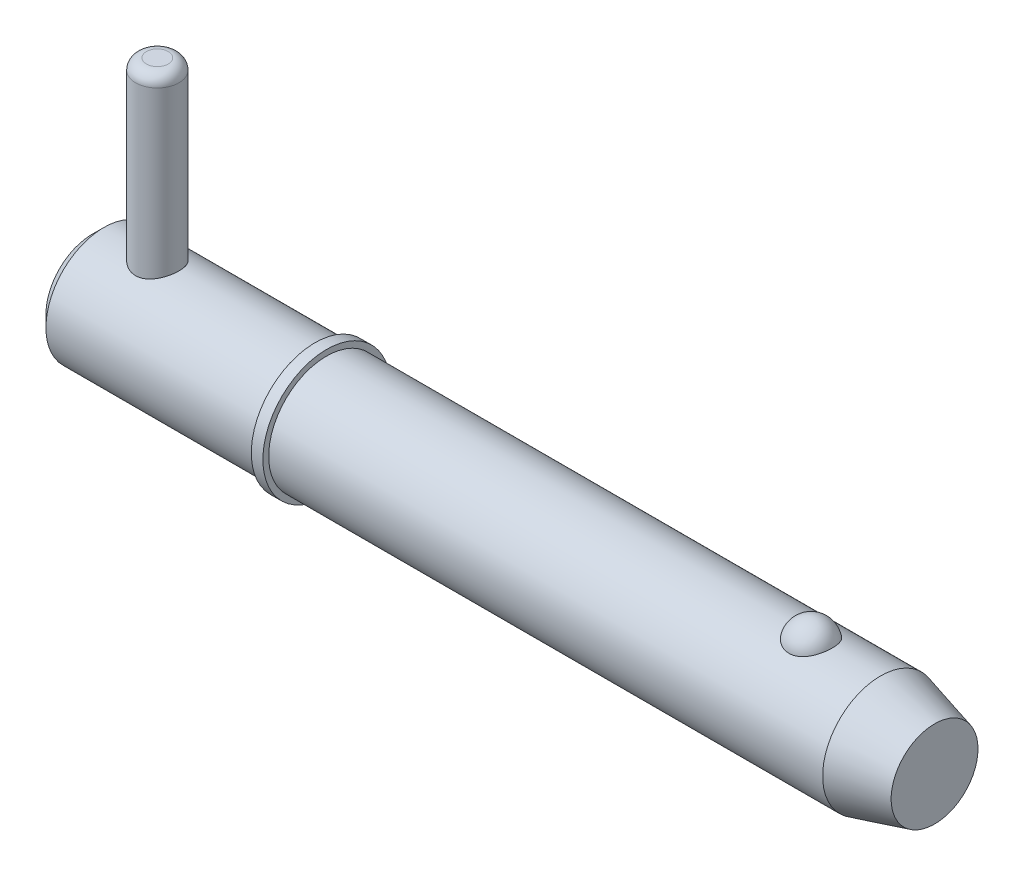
ISO-10303-21;
HEADER;
FILE_DESCRIPTION(('STEP AP214'),'2;1');
FILE_NAME('part.step','',(''),(''),'','','');
FILE_SCHEMA(('AUTOMOTIVE_DESIGN { 1 0 10303 214 1 1 1 1 }'));
ENDSEC;
DATA;
#1=APPLICATION_CONTEXT('core data for automotive mechanical design processes');
#2=APPLICATION_PROTOCOL_DEFINITION('international standard','automotive_design',2000,#1);
#3=PRODUCT_CONTEXT('',#1,'mechanical');
#4=PRODUCT('Part','Part','',(#3));
#5=PRODUCT_RELATED_PRODUCT_CATEGORY('part','',(#4));
#6=PRODUCT_DEFINITION_FORMATION('','',#4);
#7=PRODUCT_DEFINITION_CONTEXT('part definition',#1,'design');
#8=PRODUCT_DEFINITION('design','',#6,#7);
#9=PRODUCT_DEFINITION_SHAPE('','',#8);
#10=(LENGTH_UNIT() NAMED_UNIT(*) SI_UNIT(.MILLI.,.METRE.));
#11=(NAMED_UNIT(*) PLANE_ANGLE_UNIT() SI_UNIT($,.RADIAN.));
#12=(NAMED_UNIT(*) SI_UNIT($,.STERADIAN.) SOLID_ANGLE_UNIT());
#13=UNCERTAINTY_MEASURE_WITH_UNIT(LENGTH_MEASURE(1.E-05),#10,'distance_accuracy_value','');
#14=(GEOMETRIC_REPRESENTATION_CONTEXT(3) GLOBAL_UNCERTAINTY_ASSIGNED_CONTEXT((#13)) GLOBAL_UNIT_ASSIGNED_CONTEXT((#10,
#11,#12)) REPRESENTATION_CONTEXT('',''));
#15=CARTESIAN_POINT('',(0.,0.,0.));
#16=DIRECTION('',(0.,0.,1.));
#17=DIRECTION('',(1.,0.,0.));
#18=AXIS2_PLACEMENT_3D('',#15,#16,#17);
#19=CARTESIAN_POINT('',(7.14,25.4,0.));
#20=DIRECTION('',(0.,-1.,0.));
#21=DIRECTION('',(0.,0.,-1.));
#22=AXIS2_PLACEMENT_3D('',#19,#20,#21);
#23=CYLINDRICAL_SURFACE('',#22,2.38);
#24=CARTESIAN_POINT('',(7.14,-5.16,0.));
#25=DIRECTION('',(0.,1.,0.));
#26=DIRECTION('',(0.,0.,1.));
#27=AXIS2_PLACEMENT_3D('',#24,#25,#26);
#28=CIRCLE('',#27,2.38);
#29=CARTESIAN_POINT('',(7.14,-5.16,2.38));
#30=VERTEX_POINT('',#29);
#31=EDGE_CURVE('P0_E25',#30,#30,#28,.T.);
#32=ORIENTED_EDGE('',*,*,#31,.T.);
#33=EDGE_LOOP('',(#32));
#34=FACE_BOUND('',#33,.T.);
#35=CARTESIAN_POINT('',(7.14,24.21,0.));
#36=DIRECTION('',(0.,1.,0.));
#37=DIRECTION('',(0.,0.,1.));
#38=AXIS2_PLACEMENT_3D('',#35,#36,#37);
#39=CIRCLE('',#38,2.38);
#40=CARTESIAN_POINT('',(7.14,24.21,2.38));
#41=VERTEX_POINT('',#40);
#42=EDGE_CURVE('P0_E29',#41,#41,#39,.F.);
#43=ORIENTED_EDGE('',*,*,#42,.T.);
#44=EDGE_LOOP('',(#43));
#45=FACE_BOUND('',#44,.T.);
#46=ADVANCED_FACE('P0_F14',(#34,#45),#23,.T.);
#47=CARTESIAN_POINT('',(7.14,25.4,0.));
#48=DIRECTION('',(0.,1.,0.));
#49=DIRECTION('',(0.,0.,1.));
#50=AXIS2_PLACEMENT_3D('',#47,#48,#49);
#51=PLANE('',#50);
#52=CARTESIAN_POINT('',(7.14,25.4,0.));
#53=DIRECTION('',(0.,1.,0.));
#54=DIRECTION('',(0.,0.,1.));
#55=AXIS2_PLACEMENT_3D('',#52,#53,#54);
#56=CIRCLE('',#55,1.19);
#57=CARTESIAN_POINT('',(7.14,25.4,1.19));
#58=VERTEX_POINT('',#57);
#59=EDGE_CURVE('P0_E10',#58,#58,#56,.T.);
#60=ORIENTED_EDGE('',*,*,#59,.T.);
#61=EDGE_LOOP('',(#60));
#62=FACE_BOUND('',#61,.T.);
#63=ADVANCED_FACE('P0_F46',(#62),#51,.T.);
#64=CARTESIAN_POINT('',(7.14,-6.35,0.));
#65=DIRECTION('',(0.,1.,0.));
#66=DIRECTION('',(0.,0.,1.));
#67=AXIS2_PLACEMENT_3D('',#64,#65,#66);
#68=PLANE('',#67);
#69=CARTESIAN_POINT('',(7.14,-6.35,0.));
#70=DIRECTION('',(0.,1.,0.));
#71=DIRECTION('',(0.,0.,1.));
#72=AXIS2_PLACEMENT_3D('',#69,#70,#71);
#73=CIRCLE('',#72,1.19);
#74=CARTESIAN_POINT('',(7.14,-6.35,1.19));
#75=VERTEX_POINT('',#74);
#76=EDGE_CURVE('P0_E21',#75,#75,#73,.F.);
#77=ORIENTED_EDGE('',*,*,#76,.T.);
#78=EDGE_LOOP('',(#77));
#79=FACE_BOUND('',#78,.T.);
#80=ADVANCED_FACE('P0_F43',(#79),#68,.F.);
#81=CARTESIAN_POINT('',(7.14,-5.16,0.));
#82=DIRECTION('',(0.,1.,0.));
#83=DIRECTION('',(0.,0.,1.));
#84=AXIS2_PLACEMENT_3D('',#81,#82,#83);
#85=DEGENERATE_TOROIDAL_SURFACE('',#84,1.19,1.19,.T.);
#86=ORIENTED_EDGE('',*,*,#76,.F.);
#87=EDGE_LOOP('',(#86));
#88=FACE_BOUND('',#87,.T.);
#89=ORIENTED_EDGE('',*,*,#31,.F.);
#90=EDGE_LOOP('',(#89));
#91=FACE_BOUND('',#90,.T.);
#92=ADVANCED_FACE('P0_F38',(#88,#91),#85,.T.);
#93=CARTESIAN_POINT('',(7.14,24.21,0.));
#94=DIRECTION('',(0.,1.,0.));
#95=DIRECTION('',(0.,0.,1.));
#96=AXIS2_PLACEMENT_3D('',#93,#94,#95);
#97=DEGENERATE_TOROIDAL_SURFACE('',#96,1.19,1.19,.T.);
#98=ORIENTED_EDGE('',*,*,#42,.F.);
#99=EDGE_LOOP('',(#98));
#100=FACE_BOUND('',#99,.T.);
#101=ORIENTED_EDGE('',*,*,#59,.F.);
#102=EDGE_LOOP('',(#101));
#103=FACE_BOUND('',#102,.T.);
#104=ADVANCED_FACE('P0_F16',(#100,#103),#97,.T.);
#105=CLOSED_SHELL('',(#46,#63,#80,#92,#104));
#106=MANIFOLD_SOLID_BREP('P0_B1',#105);
#107=CARTESIAN_POINT('',(0.,0.,0.));
#108=DIRECTION('',(1.,0.,0.));
#109=DIRECTION('',(0.,0.,-1.));
#110=AXIS2_PLACEMENT_3D('',#107,#108,#109);
#111=CYLINDRICAL_SURFACE('',#110,6.35);
#112=CARTESIAN_POINT('',(86.4553693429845,0.,0.));
#113=DIRECTION('',(1.,0.,0.));
#114=DIRECTION('',(0.,0.,-1.));
#115=AXIS2_PLACEMENT_3D('',#112,#113,#114);
#116=CIRCLE('',#115,6.35);
#117=CARTESIAN_POINT('',(86.4553693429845,0.,-6.35));
#118=VERTEX_POINT('',#117);
#119=EDGE_CURVE('P1_E81',#118,#118,#116,.T.);
#120=ORIENTED_EDGE('',*,*,#119,.F.);
#121=EDGE_LOOP('',(#120));
#122=FACE_BOUND('',#121,.T.);
#123=CARTESIAN_POINT('',(25.7,0.,0.));
#124=DIRECTION('',(1.,0.,0.));
#125=DIRECTION('',(0.,0.,-1.));
#126=AXIS2_PLACEMENT_3D('',#123,#124,#125);
#127=CIRCLE('',#126,6.35);
#128=CARTESIAN_POINT('',(25.7,0.,-6.35));
#129=VERTEX_POINT('',#128);
#130=EDGE_CURVE('P1_E85',#129,#129,#127,.T.);
#131=ORIENTED_EDGE('',*,*,#130,.T.);
#132=EDGE_LOOP('',(#131));
#133=FACE_BOUND('',#132,.T.);
#134=CARTESIAN_POINT('',(78.8300214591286,5.87502187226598,2.40969251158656));
#135=CARTESIAN_POINT('',(78.7050305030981,5.87501645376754,2.40969773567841));
#136=CARTESIAN_POINT('',(78.5800806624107,5.87916061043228,2.39967292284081));
#137=CARTESIAN_POINT('',(78.3339091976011,5.89523112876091,2.35991730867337));
#138=CARTESIAN_POINT('',(78.2126863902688,5.90715499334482,2.33019283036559));
#139=CARTESIAN_POINT('',(77.9775170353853,5.9373956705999,2.25201402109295));
#140=CARTESIAN_POINT('',(77.8635602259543,5.95570321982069,2.20358681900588));
#141=CARTESIAN_POINT('',(77.6455735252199,5.99672067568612,2.08937987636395));
#142=CARTESIAN_POINT('',(77.5415457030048,6.01943149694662,2.02359652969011));
#143=CARTESIAN_POINT('',(77.3429437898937,6.06760647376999,1.87428969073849));
#144=CARTESIAN_POINT('',(77.2487268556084,6.09313095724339,1.79031110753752));
#145=CARTESIAN_POINT('',(77.0752557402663,6.14375873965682,1.60800178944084));
#146=CARTESIAN_POINT('',(76.9960043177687,6.16886196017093,1.50966841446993));
#147=CARTESIAN_POINT('',(76.8508457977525,6.2172460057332,1.29645884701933));
#148=CARTESIAN_POINT('',(76.7856885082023,6.24039621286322,1.18104158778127));
#149=CARTESIAN_POINT('',(76.6747035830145,6.28117277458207,0.940351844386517));
#150=CARTESIAN_POINT('',(76.6288776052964,6.29879865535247,0.815078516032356));
#151=CARTESIAN_POINT('',(76.5570234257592,6.32692073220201,0.556494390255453));
#152=CARTESIAN_POINT('',(76.531249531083,6.33732517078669,0.423102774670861));
#153=CARTESIAN_POINT('',(76.5009885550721,6.34957673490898,0.153542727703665));
#154=CARTESIAN_POINT('',(76.4965009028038,6.35142408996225,0.017374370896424));
#155=CARTESIAN_POINT('',(76.5088655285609,6.34638925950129,-0.253036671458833));
#156=CARTESIAN_POINT('',(76.5255949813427,6.33955731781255,-0.387285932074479));
#157=CARTESIAN_POINT('',(76.5798438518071,6.31794129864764,-0.650851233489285));
#158=CARTESIAN_POINT('',(76.6173636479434,6.30315707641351,-0.7801671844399));
#159=CARTESIAN_POINT('',(76.712500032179,6.26711642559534,-1.03041949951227));
#160=CARTESIAN_POINT('',(76.770143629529,6.24585130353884,-1.1513443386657));
#161=CARTESIAN_POINT('',(76.9043522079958,6.19905619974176,-1.38129800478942));
#162=CARTESIAN_POINT('',(76.9809187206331,6.17352587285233,-1.49032586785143));
#163=CARTESIAN_POINT('',(77.1517538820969,6.12080227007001,-1.69393164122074));
#164=CARTESIAN_POINT('',(77.2461008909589,6.09360200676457,-1.78844209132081));
#165=CARTESIAN_POINT('',(77.4501196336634,6.0407043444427,-1.95970536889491));
#166=CARTESIAN_POINT('',(77.5597900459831,6.01500681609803,-2.03645972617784));
#167=CARTESIAN_POINT('',(77.7891876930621,5.96867714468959,-2.16845644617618));
#168=CARTESIAN_POINT('',(77.9086522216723,5.94794910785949,-2.22412062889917));
#169=CARTESIAN_POINT('',(78.1562188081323,5.91340580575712,-2.31440992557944));
#170=CARTESIAN_POINT('',(78.2843175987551,5.89958794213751,-2.34904294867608));
#171=CARTESIAN_POINT('',(78.538582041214,5.88111049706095,-2.39491590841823));
#172=CARTESIAN_POINT('',(78.6645207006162,5.87602512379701,-2.40724512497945));
#173=CARTESIAN_POINT('',(78.9167867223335,5.87428980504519,-2.41147867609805));
#174=CARTESIAN_POINT('',(79.043114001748,5.87763817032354,-2.40338710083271));
#175=CARTESIAN_POINT('',(79.2884170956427,5.89212921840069,-2.36762715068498));
#176=CARTESIAN_POINT('',(79.4074992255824,5.90302431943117,-2.34058030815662));
#177=CARTESIAN_POINT('',(79.6392447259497,5.93113752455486,-2.2683906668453));
#178=CARTESIAN_POINT('',(79.7519075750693,5.94835614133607,-2.22324640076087));
#179=CARTESIAN_POINT('',(79.9704009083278,5.98773016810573,-2.11493806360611));
#180=CARTESIAN_POINT('',(80.076028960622,6.00998499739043,-2.05140269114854));
#181=CARTESIAN_POINT('',(80.2753006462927,6.0569014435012,-1.90842705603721));
#182=CARTESIAN_POINT('',(80.3689415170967,6.08156361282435,-1.82898313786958));
#183=CARTESIAN_POINT('',(80.5466754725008,6.13211715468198,-1.6518242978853));
#184=CARTESIAN_POINT('',(80.630055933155,6.15800825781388,-1.55339381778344));
#185=CARTESIAN_POINT('',(80.7797900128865,6.20712834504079,-1.34374214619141));
#186=CARTESIAN_POINT('',(80.8461405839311,6.23035685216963,-1.23251867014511));
#187=CARTESIAN_POINT('',(80.9623455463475,6.27251177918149,-0.99644720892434));
#188=CARTESIAN_POINT('',(81.0116072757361,6.29127762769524,-0.871278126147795));
#189=CARTESIAN_POINT('',(81.0896142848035,6.3215862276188,-0.613870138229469));
#190=CARTESIAN_POINT('',(81.1183593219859,6.33312889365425,-0.481631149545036));
#191=CARTESIAN_POINT('',(81.1547705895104,6.34782349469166,-0.213672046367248));
#192=CARTESIAN_POINT('',(81.1624134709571,6.35096613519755,-0.077948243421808));
#193=CARTESIAN_POINT('',(81.1563951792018,6.34851322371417,0.19294395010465));
#194=CARTESIAN_POINT('',(81.1427343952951,6.3429178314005,0.328112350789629));
#195=CARTESIAN_POINT('',(81.0945036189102,6.32360512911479,0.593406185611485));
#196=CARTESIAN_POINT('',(81.0600313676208,6.30992579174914,0.723552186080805));
#197=CARTESIAN_POINT('',(80.9709539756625,6.27586325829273,0.975834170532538));
#198=CARTESIAN_POINT('',(80.9163476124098,6.25547965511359,1.09796966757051));
#199=CARTESIAN_POINT('',(80.7877587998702,6.20998183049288,1.33148921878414));
#200=CARTESIAN_POINT('',(80.7136742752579,6.18484288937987,1.44281227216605));
#201=CARTESIAN_POINT('',(80.5478204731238,6.13258735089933,1.65087683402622));
#202=CARTESIAN_POINT('',(80.4560515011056,6.10547078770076,1.74761859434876));
#203=CARTESIAN_POINT('',(80.2571839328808,6.05235879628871,1.92350926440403));
#204=CARTESIAN_POINT('',(80.150133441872,6.02636017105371,2.00271146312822));
#205=CARTESIAN_POINT('',(79.9231384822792,5.97843747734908,2.14154159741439));
#206=CARTESIAN_POINT('',(79.803191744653,5.95651412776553,2.2011660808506));
#207=CARTESIAN_POINT('',(79.5445236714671,5.91812106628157,2.30250570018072));
#208=CARTESIAN_POINT('',(79.4050698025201,5.90217533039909,2.34256795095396));
#209=CARTESIAN_POINT('',(79.1203974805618,5.88063128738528,2.39615214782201));
#210=CARTESIAN_POINT('',(78.9751817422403,5.87502816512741,2.40968644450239));
#211=CARTESIAN_POINT('',(78.8300214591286,5.87502187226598,2.40969251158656));
#212=B_SPLINE_CURVE_WITH_KNOTS('',3,(#134,#135,#136,#137,#138,#139,#140,#141,#142,#143,#144,
#145,#146,#147,#148,#149,#150,#151,#152,#153,#154,#155,#156,#157,#158,#159,#160,#161,#162,#163,
#164,#165,#166,#167,#168,#169,#170,#171,#172,#173,#174,#175,#176,#177,#178,#179,#180,#181,#182,
#183,#184,#185,#186,#187,#188,#189,#190,#191,#192,#193,#194,#195,#196,#197,#198,#199,#200,#201,
#202,#203,#204,#205,#206,#207,#208,#209,#210,#211),.UNSPECIFIED.,.T.,.F.,(4,2,2,2,2,2,2,2,2,2,2,
2,2,2,2,2,2,2,2,2,2,2,2,2,2,2,2,2,2,2,2,2,2,2,2,2,2,2,4),(0.,0.374440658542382,
0.748761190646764,1.12254078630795,1.49639810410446,1.8809887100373,2.26565013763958,
2.66741104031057,3.0692063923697,3.47601794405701,3.88281858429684,4.28727498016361,
4.69173873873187,5.09674745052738,5.50178895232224,5.90865911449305,6.31549420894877,
6.71369855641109,7.11175305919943,7.48978077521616,7.86773278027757,8.23383886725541,
8.59997464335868,8.97409044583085,9.34829231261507,9.74122667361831,10.1342313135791,
10.539752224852,10.945277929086,11.3512521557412,11.7572189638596,12.1612938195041,
12.5653932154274,12.9716540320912,13.37790783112,13.782909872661,14.1879832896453,
14.6230486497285,15.0579114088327),.UNSPECIFIED.);
#213=CARTESIAN_POINT('',(78.8300214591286,5.87502187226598,2.40969251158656));
#214=VERTEX_POINT('',#213);
#215=EDGE_CURVE('P1_E35',#214,#214,#212,.T.);
#216=ORIENTED_EDGE('',*,*,#215,.T.);
#217=EDGE_LOOP('',(#216));
#218=FACE_BOUND('',#217,.T.);
#219=ADVANCED_FACE('P1_F13',(#122,#133,#218),#111,.T.);
#220=CARTESIAN_POINT('',(0.,0.,0.));
#221=DIRECTION('',(-1.,0.,0.));
#222=DIRECTION('',(0.,0.,1.));
#223=AXIS2_PLACEMENT_3D('',#220,#221,#222);
#224=PLANE('',#223);
#225=CARTESIAN_POINT('',(0.,0.,0.));
#226=DIRECTION('',(1.,0.,0.));
#227=DIRECTION('',(0.,0.,-1.));
#228=AXIS2_PLACEMENT_3D('',#225,#226,#227);
#229=CIRCLE('',#228,5.08);
#230=CARTESIAN_POINT('',(0.,0.,-5.08));
#231=VERTEX_POINT('',#230);
#232=EDGE_CURVE('P1_E9',#231,#231,#229,.T.);
#233=ORIENTED_EDGE('',*,*,#232,.F.);
#234=EDGE_LOOP('',(#233));
#235=FACE_BOUND('',#234,.T.);
#236=ADVANCED_FACE('P1_F15',(#235),#224,.T.);
#237=CARTESIAN_POINT('',(1.27,0.,0.));
#238=DIRECTION('',(1.,0.,0.));
#239=DIRECTION('',(0.,0.,-1.));
#240=AXIS2_PLACEMENT_3D('',#237,#238,#239);
#241=CONICAL_SURFACE('',#240,6.35,0.78539816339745);
#242=ORIENTED_EDGE('',*,*,#232,.T.);
#243=EDGE_LOOP('',(#242));
#244=FACE_BOUND('',#243,.T.);
#245=CARTESIAN_POINT('',(1.27,0.,0.));
#246=DIRECTION('',(1.,0.,0.));
#247=DIRECTION('',(0.,0.,-1.));
#248=AXIS2_PLACEMENT_3D('',#245,#246,#247);
#249=CIRCLE('',#248,6.35);
#250=CARTESIAN_POINT('',(1.27,0.,-6.35));
#251=VERTEX_POINT('',#250);
#252=EDGE_CURVE('P1_E26',#251,#251,#249,.T.);
#253=ORIENTED_EDGE('',*,*,#252,.F.);
#254=EDGE_LOOP('',(#253));
#255=FACE_BOUND('',#254,.T.);
#256=ADVANCED_FACE('P1_F77',(#244,#255),#241,.T.);
#257=CARTESIAN_POINT('',(0.,0.,0.));
#258=DIRECTION('',(1.,0.,0.));
#259=DIRECTION('',(0.,0.,-1.));
#260=AXIS2_PLACEMENT_3D('',#257,#258,#259);
#261=CYLINDRICAL_SURFACE('',#260,6.35);
#262=CARTESIAN_POINT('',(7.14,-5.88711304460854,2.38));
#263=CARTESIAN_POINT('',(7.01146258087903,-5.88710856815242,2.38000480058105));
#264=CARTESIAN_POINT('',(6.88295682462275,-5.89136840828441,2.36955244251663));
#265=CARTESIAN_POINT('',(6.62981934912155,-5.90782785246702,2.32820953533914));
#266=CARTESIAN_POINT('',(6.50518751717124,-5.92002722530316,2.29731958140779));
#267=CARTESIAN_POINT('',(6.26352403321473,-5.95079384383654,2.21639366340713));
#268=CARTESIAN_POINT('',(6.14647496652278,-5.96934583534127,2.16640353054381));
#269=CARTESIAN_POINT('',(5.92237941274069,-6.01070278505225,2.04885862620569));
#270=CARTESIAN_POINT('',(5.81533593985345,-6.03350901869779,1.98129858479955));
#271=CARTESIAN_POINT('',(5.60897525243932,-6.08207341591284,1.82693902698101));
#272=CARTESIAN_POINT('',(5.51022503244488,-6.10791836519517,1.73940861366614));
#273=CARTESIAN_POINT('',(5.32840561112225,-6.15892405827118,1.54914379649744));
#274=CARTESIAN_POINT('',(5.24533975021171,-6.1840846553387,1.44640616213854));
#275=CARTESIAN_POINT('',(5.09451639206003,-6.23191821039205,1.22434014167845));
#276=CARTESIAN_POINT('',(5.02737511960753,-6.25447755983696,1.10456656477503));
#277=CARTESIAN_POINT('',(4.91443001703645,-6.2935236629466,0.854429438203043));
#278=CARTESIAN_POINT('',(4.86861879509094,-6.31001251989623,0.724069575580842));
#279=CARTESIAN_POINT('',(4.80162253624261,-6.33444370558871,0.46242122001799));
#280=CARTESIAN_POINT('',(4.77946137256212,-6.34272370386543,0.331414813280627));
#281=CARTESIAN_POINT('',(4.75726677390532,-6.35101600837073,0.0672982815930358));
#282=CARTESIAN_POINT('',(4.75722615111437,-6.35103100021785,-0.0658111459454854));
#283=CARTESIAN_POINT('',(4.77870510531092,-6.3430064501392,-0.323358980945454));
#284=CARTESIAN_POINT('',(4.79915922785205,-6.33536494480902,-0.447900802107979));
#285=CARTESIAN_POINT('',(4.85925493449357,-6.31340794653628,-0.69163609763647));
#286=CARTESIAN_POINT('',(4.89889787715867,-6.29909198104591,-0.810829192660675));
#287=CARTESIAN_POINT('',(4.9967414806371,-6.26494471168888,-1.04254212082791));
#288=CARTESIAN_POINT('',(5.05520370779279,-6.24503620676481,-1.1549396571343));
#289=CARTESIAN_POINT('',(5.1887948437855,-6.20171869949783,-1.3686079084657));
#290=CARTESIAN_POINT('',(5.26392912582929,-6.17830856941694,-1.46987502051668));
#291=CARTESIAN_POINT('',(5.43386591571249,-6.12878580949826,-1.66468415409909));
#292=CARTESIAN_POINT('',(5.52956139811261,-6.10259519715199,-1.75742857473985));
#293=CARTESIAN_POINT('',(5.73530435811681,-6.05155777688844,-1.92585331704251));
#294=CARTESIAN_POINT('',(5.84535542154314,-6.02671130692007,-2.00152936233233));
#295=CARTESIAN_POINT('',(6.07982989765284,-5.98068420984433,-2.13519109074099));
#296=CARTESIAN_POINT('',(6.20451768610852,-5.95959698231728,-2.19274775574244));
#297=CARTESIAN_POINT('',(6.4628145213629,-5.92455622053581,-2.28574558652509));
#298=CARTESIAN_POINT('',(6.59641856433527,-5.91059872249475,-2.32119904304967));
#299=CARTESIAN_POINT('',(6.86087441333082,-5.8923327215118,-2.36717069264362));
#300=CARTESIAN_POINT('',(6.99147192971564,-5.8875347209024,-2.37895573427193));
#301=CARTESIAN_POINT('',(7.25283805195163,-5.88674545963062,-2.38091046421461));
#302=CARTESIAN_POINT('',(7.38360660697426,-5.89075200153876,-2.37108554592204));
#303=CARTESIAN_POINT('',(7.63510696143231,-5.90662331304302,-2.33124781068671));
#304=CARTESIAN_POINT('',(7.75602069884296,-5.91810660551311,-2.30221396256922));
#305=CARTESIAN_POINT('',(7.99120505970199,-5.94718527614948,-2.22601401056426));
#306=CARTESIAN_POINT('',(8.10547431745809,-5.96478190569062,-2.17884419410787));
#307=CARTESIAN_POINT('',(8.32888632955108,-6.00491533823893,-2.06572311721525));
#308=CARTESIAN_POINT('',(8.43767672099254,-6.02761250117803,-1.99913452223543));
#309=CARTESIAN_POINT('',(8.6429894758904,-6.07511988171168,-1.84974438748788));
#310=CARTESIAN_POINT('',(8.73950733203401,-6.09993087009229,-1.76693691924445));
#311=CARTESIAN_POINT('',(8.9238741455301,-6.1507686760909,-1.58125563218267));
#312=CARTESIAN_POINT('',(9.01078732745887,-6.17677301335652,-1.47744327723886));
#313=CARTESIAN_POINT('',(9.16607127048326,-6.22556172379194,-1.25606967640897));
#314=CARTESIAN_POINT('',(9.23444197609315,-6.24834608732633,-1.13850838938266));
#315=CARTESIAN_POINT('',(9.3502493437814,-6.28811144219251,-0.893050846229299));
#316=CARTESIAN_POINT('',(9.39775808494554,-6.30511236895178,-0.765192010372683));
#317=CARTESIAN_POINT('',(9.47032640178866,-6.33145833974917,-0.502514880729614));
#318=CARTESIAN_POINT('',(9.49539651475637,-6.34080697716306,-0.367699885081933));
#319=CARTESIAN_POINT('',(9.52124059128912,-6.35045496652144,-0.103396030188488));
#320=CARTESIAN_POINT('',(9.52334421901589,-6.35124952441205,0.025945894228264));
#321=CARTESIAN_POINT('',(9.50661518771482,-6.34499064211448,0.283061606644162));
#322=CARTESIAN_POINT('',(9.48778504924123,-6.33793814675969,0.410835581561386));
#323=CARTESIAN_POINT('',(9.43065630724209,-6.31700307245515,0.658028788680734));
#324=CARTESIAN_POINT('',(9.39284291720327,-6.30329098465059,0.7775756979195));
#325=CARTESIAN_POINT('',(9.29930406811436,-6.27046903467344,1.00863789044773));
#326=CARTESIAN_POINT('',(9.2435752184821,-6.25135815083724,1.12015164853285));
#327=CARTESIAN_POINT('',(9.11312349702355,-6.20865254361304,1.33711407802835));
#328=CARTESIAN_POINT('',(9.03770094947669,-6.18490316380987,1.44211105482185));
#329=CARTESIAN_POINT('',(8.87110640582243,-6.13583718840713,1.63836897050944));
#330=CARTESIAN_POINT('',(8.77992879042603,-6.11052003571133,1.72962498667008));
#331=CARTESIAN_POINT('',(8.57869799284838,-6.05953829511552,1.90076098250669));
#332=CARTESIAN_POINT('',(8.46790320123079,-6.03392573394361,1.97978778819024));
#333=CARTESIAN_POINT('',(8.23379693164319,-5.98676607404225,2.11813466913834));
#334=CARTESIAN_POINT('',(8.11048418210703,-5.9652193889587,2.17745273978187));
#335=CARTESIAN_POINT('',(7.84900037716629,-5.92818393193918,2.27641807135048));
#336=CARTESIAN_POINT('',(7.71041678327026,-5.91299857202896,2.31510015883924));
#337=CARTESIAN_POINT('',(7.42787316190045,-5.89246887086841,2.36688002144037));
#338=CARTESIAN_POINT('',(7.28391673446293,-5.88711805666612,2.37999462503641));
#339=CARTESIAN_POINT('',(7.14,-5.88711304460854,2.38));
#340=B_SPLINE_CURVE_WITH_KNOTS('',3,(#262,#263,#264,#265,#266,#267,#268,#269,#270,#271,#272,
#273,#274,#275,#276,#277,#278,#279,#280,#281,#282,#283,#284,#285,#286,#287,#288,#289,#290,#291,
#292,#293,#294,#295,#296,#297,#298,#299,#300,#301,#302,#303,#304,#305,#306,#307,#308,#309,#310,
#311,#312,#313,#314,#315,#316,#317,#318,#319,#320,#321,#322,#323,#324,#325,#326,#327,#328,#329,
#330,#331,#332,#333,#334,#335,#336,#337,#338,#339),.UNSPECIFIED.,.T.,.F.,(4,2,2,2,2,2,2,2,2,2,2,
2,2,2,2,2,2,2,2,2,2,2,2,2,2,2,2,2,2,2,2,2,2,2,2,2,2,2,4),(0.,0.385076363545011,
0.770141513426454,1.15428843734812,1.53855071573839,1.94016118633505,2.3418570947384,
2.75720522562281,3.1724093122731,3.569721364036,3.96690431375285,4.34445758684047,
4.72203759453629,5.10511017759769,5.48830640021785,5.89390240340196,6.29959991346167,
6.71428455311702,7.12873839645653,7.52034494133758,7.91185376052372,8.28480528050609,
8.65783318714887,9.0448340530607,9.43197664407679,9.84363087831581,10.2552863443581,
10.6655081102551,11.0755371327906,11.4616919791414,11.847800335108,12.224507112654,
12.6012852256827,12.9938941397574,13.386643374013,13.8000944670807,14.2135876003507,
14.6450218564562,15.0761720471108),.UNSPECIFIED.);
#341=CARTESIAN_POINT('',(7.14,-5.88711304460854,2.38));
#342=VERTEX_POINT('',#341);
#343=EDGE_CURVE('P1_E17',#342,#342,#340,.T.);
#344=ORIENTED_EDGE('',*,*,#343,.F.);
#345=EDGE_LOOP('',(#344));
#346=FACE_BOUND('',#345,.T.);
#347=CARTESIAN_POINT('',(7.14,5.88711304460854,2.38));
#348=CARTESIAN_POINT('',(7.26853741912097,5.88710856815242,2.38000480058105));
#349=CARTESIAN_POINT('',(7.39704317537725,5.89136840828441,2.36955244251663));
#350=CARTESIAN_POINT('',(7.65018065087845,5.90782785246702,2.32820953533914));
#351=CARTESIAN_POINT('',(7.77481248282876,5.92002722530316,2.29731958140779));
#352=CARTESIAN_POINT('',(8.01647596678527,5.95079384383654,2.21639366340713));
#353=CARTESIAN_POINT('',(8.13352503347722,5.96934583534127,2.16640353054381));
#354=CARTESIAN_POINT('',(8.35762058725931,6.01070278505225,2.04885862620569));
#355=CARTESIAN_POINT('',(8.46466406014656,6.03350901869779,1.98129858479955));
#356=CARTESIAN_POINT('',(8.67102474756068,6.08207341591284,1.82693902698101));
#357=CARTESIAN_POINT('',(8.76977496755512,6.10791836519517,1.73940861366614));
#358=CARTESIAN_POINT('',(8.95159438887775,6.15892405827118,1.54914379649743));
#359=CARTESIAN_POINT('',(9.03466024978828,6.1840846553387,1.44640616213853));
#360=CARTESIAN_POINT('',(9.18548360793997,6.23191821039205,1.22434014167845));
#361=CARTESIAN_POINT('',(9.25262488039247,6.25447755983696,1.10456656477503));
#362=CARTESIAN_POINT('',(9.36556998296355,6.2935236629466,0.854429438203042));
#363=CARTESIAN_POINT('',(9.41138120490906,6.31001251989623,0.72406957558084));
#364=CARTESIAN_POINT('',(9.47837746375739,6.33444370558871,0.462421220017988));
#365=CARTESIAN_POINT('',(9.50053862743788,6.34272370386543,0.331414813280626));
#366=CARTESIAN_POINT('',(9.52273322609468,6.35101600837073,0.0672982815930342));
#367=CARTESIAN_POINT('',(9.52277384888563,6.35103100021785,-0.0658111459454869));
#368=CARTESIAN_POINT('',(9.50129489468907,6.3430064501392,-0.323358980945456));
#369=CARTESIAN_POINT('',(9.48084077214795,6.33536494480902,-0.447900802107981));
#370=CARTESIAN_POINT('',(9.42074506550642,6.31340794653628,-0.691636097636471));
#371=CARTESIAN_POINT('',(9.38110212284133,6.29909198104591,-0.810829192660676));
#372=CARTESIAN_POINT('',(9.2832585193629,6.26494471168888,-1.04254212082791));
#373=CARTESIAN_POINT('',(9.22479629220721,6.24503620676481,-1.1549396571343));
#374=CARTESIAN_POINT('',(9.0912051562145,6.20171869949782,-1.3686079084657));
#375=CARTESIAN_POINT('',(9.0160708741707,6.17830856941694,-1.46987502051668));
#376=CARTESIAN_POINT('',(8.84613408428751,6.12878580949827,-1.66468415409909));
#377=CARTESIAN_POINT('',(8.75043860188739,6.10259519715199,-1.75742857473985));
#378=CARTESIAN_POINT('',(8.54469564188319,6.05155777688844,-1.92585331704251));
#379=CARTESIAN_POINT('',(8.43464457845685,6.02671130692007,-2.00152936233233));
#380=CARTESIAN_POINT('',(8.20017010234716,5.98068420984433,-2.13519109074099));
#381=CARTESIAN_POINT('',(8.07548231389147,5.95959698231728,-2.19274775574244));
#382=CARTESIAN_POINT('',(7.8171854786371,5.9245562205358,-2.28574558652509));
#383=CARTESIAN_POINT('',(7.68358143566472,5.91059872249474,-2.32119904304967));
#384=CARTESIAN_POINT('',(7.41912558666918,5.8923327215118,-2.36717069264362));
#385=CARTESIAN_POINT('',(7.28852807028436,5.8875347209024,-2.37895573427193));
#386=CARTESIAN_POINT('',(7.02716194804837,5.88674545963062,-2.38091046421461));
#387=CARTESIAN_POINT('',(6.89639339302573,5.89075200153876,-2.37108554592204));
#388=CARTESIAN_POINT('',(6.64489303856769,5.90662331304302,-2.33124781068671));
#389=CARTESIAN_POINT('',(6.52397930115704,5.91810660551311,-2.30221396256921));
#390=CARTESIAN_POINT('',(6.288794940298,5.94718527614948,-2.22601401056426));
#391=CARTESIAN_POINT('',(6.17452568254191,5.96478190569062,-2.17884419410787));
#392=CARTESIAN_POINT('',(5.95111367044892,6.00491533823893,-2.06572311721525));
#393=CARTESIAN_POINT('',(5.84232327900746,6.02761250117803,-1.99913452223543));
#394=CARTESIAN_POINT('',(5.6370105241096,6.07511988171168,-1.84974438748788));
#395=CARTESIAN_POINT('',(5.54049266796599,6.09993087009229,-1.76693691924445));
#396=CARTESIAN_POINT('',(5.3561258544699,6.1507686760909,-1.58125563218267));
#397=CARTESIAN_POINT('',(5.26921267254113,6.17677301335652,-1.47744327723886));
#398=CARTESIAN_POINT('',(5.11392872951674,6.22556172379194,-1.25606967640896));
#399=CARTESIAN_POINT('',(5.04555802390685,6.24834608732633,-1.13850838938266));
#400=CARTESIAN_POINT('',(4.9297506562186,6.28811144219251,-0.893050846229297));
#401=CARTESIAN_POINT('',(4.88224191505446,6.30511236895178,-0.76519201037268));
#402=CARTESIAN_POINT('',(4.80967359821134,6.33145833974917,-0.502514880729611));
#403=CARTESIAN_POINT('',(4.78460348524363,6.34080697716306,-0.36769988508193));
#404=CARTESIAN_POINT('',(4.75875940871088,6.35045496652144,-0.103396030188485));
#405=CARTESIAN_POINT('',(4.75665578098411,6.35124952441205,0.025945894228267));
#406=CARTESIAN_POINT('',(4.77338481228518,6.34499064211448,0.283061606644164));
#407=CARTESIAN_POINT('',(4.79221495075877,6.33793814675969,0.410835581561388));
#408=CARTESIAN_POINT('',(4.84934369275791,6.31700307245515,0.658028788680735));
#409=CARTESIAN_POINT('',(4.88715708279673,6.30329098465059,0.777575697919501));
#410=CARTESIAN_POINT('',(4.98069593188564,6.27046903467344,1.00863789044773));
#411=CARTESIAN_POINT('',(5.0364247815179,6.25135815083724,1.12015164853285));
#412=CARTESIAN_POINT('',(5.16687650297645,6.20865254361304,1.33711407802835));
#413=CARTESIAN_POINT('',(5.24229905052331,6.18490316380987,1.44211105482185));
#414=CARTESIAN_POINT('',(5.40889359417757,6.13583718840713,1.63836897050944));
#415=CARTESIAN_POINT('',(5.50007120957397,6.11052003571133,1.72962498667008));
#416=CARTESIAN_POINT('',(5.70130200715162,6.05953829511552,1.90076098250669));
#417=CARTESIAN_POINT('',(5.81209679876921,6.03392573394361,1.97978778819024));
#418=CARTESIAN_POINT('',(6.04620306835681,5.98676607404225,2.11813466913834));
#419=CARTESIAN_POINT('',(6.16951581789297,5.9652193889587,2.17745273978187));
#420=CARTESIAN_POINT('',(6.43099962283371,5.92818393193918,2.27641807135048));
#421=CARTESIAN_POINT('',(6.56958321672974,5.91299857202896,2.31510015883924));
#422=CARTESIAN_POINT('',(6.85212683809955,5.89246887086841,2.36688002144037));
#423=CARTESIAN_POINT('',(6.99608326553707,5.88711805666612,2.37999462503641));
#424=CARTESIAN_POINT('',(7.14,5.88711304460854,2.38));
#425=B_SPLINE_CURVE_WITH_KNOTS('',3,(#347,#348,#349,#350,#351,#352,#353,#354,#355,#356,#357,
#358,#359,#360,#361,#362,#363,#364,#365,#366,#367,#368,#369,#370,#371,#372,#373,#374,#375,#376,
#377,#378,#379,#380,#381,#382,#383,#384,#385,#386,#387,#388,#389,#390,#391,#392,#393,#394,#395,
#396,#397,#398,#399,#400,#401,#402,#403,#404,#405,#406,#407,#408,#409,#410,#411,#412,#413,#414,
#415,#416,#417,#418,#419,#420,#421,#422,#423,#424),.UNSPECIFIED.,.T.,.F.,(4,2,2,2,2,2,2,2,2,2,2,
2,2,2,2,2,2,2,2,2,2,2,2,2,2,2,2,2,2,2,2,2,2,2,2,2,2,2,4),(0.,0.385076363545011,
0.770141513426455,1.15428843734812,1.53855071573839,1.94016118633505,2.3418570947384,
2.75720522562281,3.1724093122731,3.56972136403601,3.96690431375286,4.34445758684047,
4.72203759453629,5.10511017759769,5.48830640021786,5.89390240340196,6.29959991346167,
6.71428455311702,7.12873839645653,7.52034494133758,7.91185376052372,8.2848052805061,
8.65783318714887,9.0448340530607,9.43197664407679,9.84363087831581,10.2552863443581,
10.6655081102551,11.0755371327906,11.4616919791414,11.847800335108,12.2245071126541,
12.6012852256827,12.9938941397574,13.386643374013,13.8000944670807,14.2135876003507,
14.6450218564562,15.0761720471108),.UNSPECIFIED.);
#426=CARTESIAN_POINT('',(7.14,5.88711304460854,2.38));
#427=VERTEX_POINT('',#426);
#428=EDGE_CURVE('P1_E43',#427,#427,#425,.T.);
#429=ORIENTED_EDGE('',*,*,#428,.F.);
#430=EDGE_LOOP('',(#429));
#431=FACE_BOUND('',#430,.T.);
#432=ORIENTED_EDGE('',*,*,#252,.T.);
#433=EDGE_LOOP('',(#432));
#434=FACE_BOUND('',#433,.T.);
#435=CARTESIAN_POINT('',(24.43,0.,0.));
#436=DIRECTION('',(1.,0.,0.));
#437=DIRECTION('',(0.,0.,-1.));
#438=AXIS2_PLACEMENT_3D('',#435,#436,#437);
#439=CIRCLE('',#438,6.35);
#440=CARTESIAN_POINT('',(24.43,0.,-6.35));
#441=VERTEX_POINT('',#440);
#442=EDGE_CURVE('P1_E31',#441,#441,#439,.T.);
#443=ORIENTED_EDGE('',*,*,#442,.F.);
#444=EDGE_LOOP('',(#443));
#445=FACE_BOUND('',#444,.T.);
#446=ADVANCED_FACE('P1_F103',(#346,#431,#434,#445),#261,.T.);
#447=CARTESIAN_POINT('',(24.43,6.35,0.));
#448=DIRECTION('',(-1.,0.,0.));
#449=DIRECTION('',(0.,0.,1.));
#450=AXIS2_PLACEMENT_3D('',#447,#448,#449);
#451=PLANE('',#450);
#452=ORIENTED_EDGE('',*,*,#442,.T.);
#453=EDGE_LOOP('',(#452));
#454=FACE_BOUND('',#453,.T.);
#455=CARTESIAN_POINT('',(24.43,0.,0.));
#456=DIRECTION('',(1.,0.,0.));
#457=DIRECTION('',(0.,0.,-1.));
#458=AXIS2_PLACEMENT_3D('',#455,#456,#457);
#459=CIRCLE('',#458,6.985);
#460=CARTESIAN_POINT('',(24.43,0.,-6.985));
#461=VERTEX_POINT('',#460);
#462=EDGE_CURVE('P1_E91',#461,#461,#459,.T.);
#463=ORIENTED_EDGE('',*,*,#462,.F.);
#464=EDGE_LOOP('',(#463));
#465=FACE_BOUND('',#464,.T.);
#466=ADVANCED_FACE('P1_F100',(#454,#465),#451,.T.);
#467=CARTESIAN_POINT('',(0.,0.,0.));
#468=DIRECTION('',(1.,0.,0.));
#469=DIRECTION('',(0.,0.,-1.));
#470=AXIS2_PLACEMENT_3D('',#467,#468,#469);
#471=CYLINDRICAL_SURFACE('',#470,6.985);
#472=ORIENTED_EDGE('',*,*,#462,.T.);
#473=EDGE_LOOP('',(#472));
#474=FACE_BOUND('',#473,.T.);
#475=CARTESIAN_POINT('',(25.7,0.,0.));
#476=DIRECTION('',(1.,0.,0.));
#477=DIRECTION('',(0.,0.,-1.));
#478=AXIS2_PLACEMENT_3D('',#475,#476,#477);
#479=CIRCLE('',#478,6.985);
#480=CARTESIAN_POINT('',(25.7,0.,-6.985));
#481=VERTEX_POINT('',#480);
#482=EDGE_CURVE('P1_E88',#481,#481,#479,.T.);
#483=ORIENTED_EDGE('',*,*,#482,.F.);
#484=EDGE_LOOP('',(#483));
#485=FACE_BOUND('',#484,.T.);
#486=ADVANCED_FACE('P1_F68',(#474,#485),#471,.T.);
#487=CARTESIAN_POINT('',(25.7,6.985,0.));
#488=DIRECTION('',(1.,0.,0.));
#489=DIRECTION('',(0.,0.,-1.));
#490=AXIS2_PLACEMENT_3D('',#487,#488,#489);
#491=PLANE('',#490);
#492=ORIENTED_EDGE('',*,*,#482,.T.);
#493=EDGE_LOOP('',(#492));
#494=FACE_BOUND('',#493,.T.);
#495=ORIENTED_EDGE('',*,*,#130,.F.);
#496=EDGE_LOOP('',(#495));
#497=FACE_BOUND('',#496,.T.);
#498=ADVANCED_FACE('P1_F62',(#494,#497),#491,.T.);
#499=CARTESIAN_POINT('',(92.38,0.,0.));
#500=DIRECTION('',(-1.,0.,0.));
#501=DIRECTION('',(0.,0.,1.));
#502=AXIS2_PLACEMENT_3D('',#499,#500,#501);
#503=CONICAL_SURFACE('',#502,4.76250000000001,0.26179938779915);
#504=ORIENTED_EDGE('',*,*,#119,.T.);
#505=EDGE_LOOP('',(#504));
#506=FACE_BOUND('',#505,.T.);
#507=CARTESIAN_POINT('',(92.38,0.,0.));
#508=DIRECTION('',(1.,0.,0.));
#509=DIRECTION('',(0.,0.,-1.));
#510=AXIS2_PLACEMENT_3D('',#507,#508,#509);
#511=CIRCLE('',#510,4.76250000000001);
#512=CARTESIAN_POINT('',(92.38,0.,-4.76250000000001));
#513=VERTEX_POINT('',#512);
#514=EDGE_CURVE('P1_E42',#513,#513,#511,.T.);
#515=ORIENTED_EDGE('',*,*,#514,.F.);
#516=EDGE_LOOP('',(#515));
#517=FACE_BOUND('',#516,.T.);
#518=ADVANCED_FACE('P1_F59',(#506,#517),#503,.T.);
#519=CARTESIAN_POINT('',(92.38,4.76250000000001,0.));
#520=DIRECTION('',(1.,0.,0.));
#521=DIRECTION('',(0.,0.,-1.));
#522=AXIS2_PLACEMENT_3D('',#519,#520,#521);
#523=PLANE('',#522);
#524=ORIENTED_EDGE('',*,*,#514,.T.);
#525=EDGE_LOOP('',(#524));
#526=FACE_BOUND('',#525,.T.);
#527=ADVANCED_FACE('P1_F55',(#526),#523,.T.);
#528=CARTESIAN_POINT('',(78.8300214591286,5.715,0.));
#529=DIRECTION('',(-1.,0.,0.));
#530=DIRECTION('',(0.,1.,0.));
#531=AXIS2_PLACEMENT_3D('',#528,#529,#530);
#532=SPHERICAL_SURFACE('',#531,2.41499999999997);
#533=ORIENTED_EDGE('',*,*,#215,.F.);
#534=EDGE_LOOP('',(#533));
#535=FACE_BOUND('',#534,.T.);
#536=ADVANCED_FACE('P1_F50',(#535),#532,.T.);
#537=CARTESIAN_POINT('',(7.14,-6.985,0.));
#538=DIRECTION('',(0.,1.,0.));
#539=DIRECTION('',(0.,0.,1.));
#540=AXIS2_PLACEMENT_3D('',#537,#538,#539);
#541=CYLINDRICAL_SURFACE('',#540,2.38);
#542=ORIENTED_EDGE('',*,*,#343,.T.);
#543=EDGE_LOOP('',(#542));
#544=FACE_BOUND('',#543,.T.);
#545=ORIENTED_EDGE('',*,*,#428,.T.);
#546=EDGE_LOOP('',(#545));
#547=FACE_BOUND('',#546,.T.);
#548=ADVANCED_FACE('P1_F54',(#544,#547),#541,.F.);
#549=CLOSED_SHELL('',(#219,#236,#256,#446,#466,#486,#498,#518,#527,#536,#548));
#550=MANIFOLD_SOLID_BREP('P1_B1',#549);
#551=ADVANCED_BREP_SHAPE_REPRESENTATION('',(#18,#106,#550),#14);
#552=SHAPE_DEFINITION_REPRESENTATION(#9,#551);
ENDSEC;
END-ISO-10303-21;
